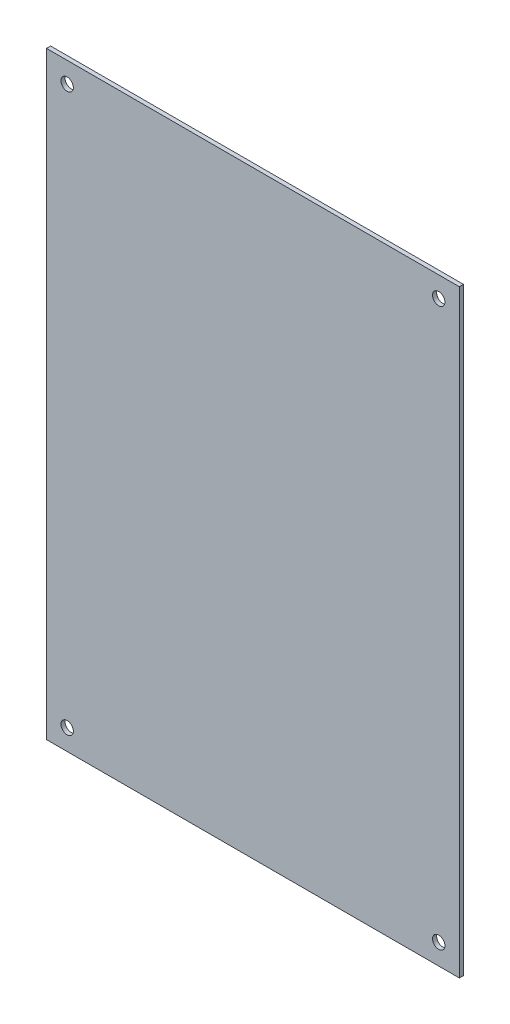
ISO-10303-21;
HEADER;
FILE_DESCRIPTION(('STEP AP214'),'2;1');
FILE_NAME('part.step','',(''),(''),'','','');
FILE_SCHEMA(('AUTOMOTIVE_DESIGN { 1 0 10303 214 1 1 1 1 }'));
ENDSEC;
DATA;
#1=APPLICATION_CONTEXT('core data for automotive mechanical design processes');
#2=APPLICATION_PROTOCOL_DEFINITION('international standard','automotive_design',2000,#1);
#3=PRODUCT_CONTEXT('',#1,'mechanical');
#4=PRODUCT('Part','Part','',(#3));
#5=PRODUCT_RELATED_PRODUCT_CATEGORY('part','',(#4));
#6=PRODUCT_DEFINITION_FORMATION('','',#4);
#7=PRODUCT_DEFINITION_CONTEXT('part definition',#1,'design');
#8=PRODUCT_DEFINITION('design','',#6,#7);
#9=PRODUCT_DEFINITION_SHAPE('','',#8);
#10=(LENGTH_UNIT() NAMED_UNIT(*) SI_UNIT(.MILLI.,.METRE.));
#11=(NAMED_UNIT(*) PLANE_ANGLE_UNIT() SI_UNIT($,.RADIAN.));
#12=(NAMED_UNIT(*) SI_UNIT($,.STERADIAN.) SOLID_ANGLE_UNIT());
#13=UNCERTAINTY_MEASURE_WITH_UNIT(LENGTH_MEASURE(1.E-05),#10,'distance_accuracy_value','');
#14=(GEOMETRIC_REPRESENTATION_CONTEXT(3) GLOBAL_UNCERTAINTY_ASSIGNED_CONTEXT((#13)) GLOBAL_UNIT_ASSIGNED_CONTEXT((#10,
#11,#12)) REPRESENTATION_CONTEXT('',''));
#15=CARTESIAN_POINT('',(0.,0.,0.));
#16=DIRECTION('',(0.,0.,1.));
#17=DIRECTION('',(1.,0.,0.));
#18=AXIS2_PLACEMENT_3D('',#15,#16,#17);
#19=CARTESIAN_POINT('',(-50.,0.,1.));
#20=DIRECTION('',(1.,0.,0.));
#21=DIRECTION('',(0.,1.,0.));
#22=AXIS2_PLACEMENT_3D('',#19,#20,#21);
#23=PLANE('',#22);
#24=DIRECTION('',(0.,-1.,0.));
#25=VECTOR('',#24,1.);
#26=CARTESIAN_POINT('',(-50.,0.,0.));
#27=LINE('',#26,#25);
#28=CARTESIAN_POINT('',(-50.,0.,0.));
#29=VERTEX_POINT('',#28);
#30=CARTESIAN_POINT('',(-50.0000000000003,-145.,0.));
#31=VERTEX_POINT('',#30);
#32=EDGE_CURVE('E83',#29,#31,#27,.T.);
#33=ORIENTED_EDGE('',*,*,#32,.T.);
#34=DIRECTION('',(0.,0.,-1.));
#35=VECTOR('',#34,1.);
#36=CARTESIAN_POINT('',(-50.0000000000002,-145.,1.));
#37=LINE('',#36,#35);
#38=CARTESIAN_POINT('',(-50.0000000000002,-145.,1.));
#39=VERTEX_POINT('',#38);
#40=EDGE_CURVE('E11',#39,#31,#37,.T.);
#41=ORIENTED_EDGE('',*,*,#40,.F.);
#42=DIRECTION('',(0.,-1.,0.));
#43=VECTOR('',#42,1.);
#44=CARTESIAN_POINT('',(-50.,0.,1.));
#45=LINE('',#44,#43);
#46=CARTESIAN_POINT('',(-50.,0.,1.));
#47=VERTEX_POINT('',#46);
#48=EDGE_CURVE('E112',#47,#39,#45,.T.);
#49=ORIENTED_EDGE('',*,*,#48,.F.);
#50=DIRECTION('',(0.,0.,-1.));
#51=VECTOR('',#50,1.);
#52=CARTESIAN_POINT('',(-50.,0.,1.));
#53=LINE('',#52,#51);
#54=EDGE_CURVE('E96',#47,#29,#53,.T.);
#55=ORIENTED_EDGE('',*,*,#54,.T.);
#56=EDGE_LOOP('',(#33,#41,#49,#55));
#57=FACE_BOUND('',#56,.T.);
#58=ADVANCED_FACE('F38',(#57),#23,.F.);
#59=CARTESIAN_POINT('',(-50.0000000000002,-145.,1.));
#60=DIRECTION('',(0.,1.,0.));
#61=DIRECTION('',(0.,0.,1.));
#62=AXIS2_PLACEMENT_3D('',#59,#60,#61);
#63=PLANE('',#62);
#64=DIRECTION('',(1.,0.,0.));
#65=VECTOR('',#64,1.);
#66=CARTESIAN_POINT('',(-50.0000000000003,-145.,0.));
#67=LINE('',#66,#65);
#68=CARTESIAN_POINT('',(49.9999999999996,-145.,-2.22044604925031E-13));
#69=VERTEX_POINT('',#68);
#70=EDGE_CURVE('E79',#31,#69,#67,.T.);
#71=ORIENTED_EDGE('',*,*,#70,.T.);
#72=DIRECTION('',(0.,0.,-1.));
#73=VECTOR('',#72,1.);
#74=CARTESIAN_POINT('',(49.9999999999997,-145.,0.999999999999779));
#75=LINE('',#74,#73);
#76=CARTESIAN_POINT('',(49.9999999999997,-145.,0.999999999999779));
#77=VERTEX_POINT('',#76);
#78=EDGE_CURVE('E46',#77,#69,#75,.T.);
#79=ORIENTED_EDGE('',*,*,#78,.F.);
#80=DIRECTION('',(1.,0.,0.));
#81=VECTOR('',#80,1.);
#82=CARTESIAN_POINT('',(-50.0000000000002,-145.,1.));
#83=LINE('',#82,#81);
#84=EDGE_CURVE('E92',#39,#77,#83,.T.);
#85=ORIENTED_EDGE('',*,*,#84,.F.);
#86=ORIENTED_EDGE('',*,*,#40,.T.);
#87=EDGE_LOOP('',(#71,#79,#85,#86));
#88=FACE_BOUND('',#87,.T.);
#89=ADVANCED_FACE('F91',(#88),#63,.F.);
#90=CARTESIAN_POINT('',(50.,0.,1.));
#91=DIRECTION('',(-1.,0.,0.));
#92=DIRECTION('',(0.,-1.,0.));
#93=AXIS2_PLACEMENT_3D('',#90,#91,#92);
#94=PLANE('',#93);
#95=DIRECTION('',(0.,1.,0.));
#96=VECTOR('',#95,1.);
#97=CARTESIAN_POINT('',(50.,0.,0.));
#98=LINE('',#97,#96);
#99=CARTESIAN_POINT('',(50.,0.,0.));
#100=VERTEX_POINT('',#99);
#101=EDGE_CURVE('E84',#69,#100,#98,.T.);
#102=ORIENTED_EDGE('',*,*,#101,.T.);
#103=DIRECTION('',(0.,0.,-1.));
#104=VECTOR('',#103,1.);
#105=CARTESIAN_POINT('',(50.,0.,1.));
#106=LINE('',#105,#104);
#107=CARTESIAN_POINT('',(50.,0.,1.));
#108=VERTEX_POINT('',#107);
#109=EDGE_CURVE('E123',#108,#100,#106,.T.);
#110=ORIENTED_EDGE('',*,*,#109,.F.);
#111=DIRECTION('',(0.,1.,0.));
#112=VECTOR('',#111,1.);
#113=CARTESIAN_POINT('',(50.,0.,1.));
#114=LINE('',#113,#112);
#115=EDGE_CURVE('E58',#77,#108,#114,.T.);
#116=ORIENTED_EDGE('',*,*,#115,.F.);
#117=ORIENTED_EDGE('',*,*,#78,.T.);
#118=EDGE_LOOP('',(#102,#110,#116,#117));
#119=FACE_BOUND('',#118,.T.);
#120=ADVANCED_FACE('F129',(#119),#94,.F.);
#121=CARTESIAN_POINT('',(-50.,0.,1.));
#122=DIRECTION('',(0.,-1.,0.));
#123=DIRECTION('',(0.,0.,-1.));
#124=AXIS2_PLACEMENT_3D('',#121,#122,#123);
#125=PLANE('',#124);
#126=DIRECTION('',(-1.,0.,0.));
#127=VECTOR('',#126,1.);
#128=CARTESIAN_POINT('',(-50.,0.,0.));
#129=LINE('',#128,#127);
#130=EDGE_CURVE('E109',#100,#29,#129,.T.);
#131=ORIENTED_EDGE('',*,*,#130,.T.);
#132=ORIENTED_EDGE('',*,*,#54,.F.);
#133=DIRECTION('',(-1.,0.,0.));
#134=VECTOR('',#133,1.);
#135=CARTESIAN_POINT('',(-50.,0.,1.));
#136=LINE('',#135,#134);
#137=EDGE_CURVE('E53',#108,#47,#136,.T.);
#138=ORIENTED_EDGE('',*,*,#137,.F.);
#139=ORIENTED_EDGE('',*,*,#109,.T.);
#140=EDGE_LOOP('',(#131,#132,#138,#139));
#141=FACE_BOUND('',#140,.T.);
#142=ADVANCED_FACE('F131',(#141),#125,.F.);
#143=CARTESIAN_POINT('',(-50.0000000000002,-145.,1.));
#144=DIRECTION('',(0.,0.,1.));
#145=DIRECTION('',(1.,0.,0.));
#146=AXIS2_PLACEMENT_3D('',#143,#144,#145);
#147=PLANE('',#146);
#148=CARTESIAN_POINT('',(-45.,-4.99999999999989,0.999999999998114));
#149=DIRECTION('',(0.,0.,1.));
#150=DIRECTION('',(1.,0.,0.));
#151=AXIS2_PLACEMENT_3D('',#148,#149,#150);
#152=CIRCLE('',#151,1.5);
#153=CARTESIAN_POINT('',(-43.5,-4.99999999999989,0.999999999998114));
#154=VERTEX_POINT('',#153);
#155=EDGE_CURVE('E238',#154,#154,#152,.T.);
#156=ORIENTED_EDGE('',*,*,#155,.F.);
#157=EDGE_LOOP('',(#156));
#158=FACE_BOUND('',#157,.T.);
#159=CARTESIAN_POINT('',(45.,-5.00000000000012,1.));
#160=DIRECTION('',(0.,0.,1.));
#161=DIRECTION('',(1.,0.,0.));
#162=AXIS2_PLACEMENT_3D('',#159,#160,#161);
#163=CIRCLE('',#162,1.5);
#164=CARTESIAN_POINT('',(46.5,-5.00000000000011,1.));
#165=VERTEX_POINT('',#164);
#166=EDGE_CURVE('E243',#165,#165,#163,.T.);
#167=ORIENTED_EDGE('',*,*,#166,.F.);
#168=EDGE_LOOP('',(#167));
#169=FACE_BOUND('',#168,.T.);
#170=CARTESIAN_POINT('',(-45.0000000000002,-140.,0.999999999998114));
#171=DIRECTION('',(0.,0.,1.));
#172=DIRECTION('',(1.,0.,0.));
#173=AXIS2_PLACEMENT_3D('',#170,#171,#172);
#174=CIRCLE('',#173,1.5);
#175=CARTESIAN_POINT('',(-43.5000000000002,-140.,0.999999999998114));
#176=VERTEX_POINT('',#175);
#177=EDGE_CURVE('E253',#176,#176,#174,.T.);
#178=ORIENTED_EDGE('',*,*,#177,.F.);
#179=EDGE_LOOP('',(#178));
#180=FACE_BOUND('',#179,.T.);
#181=CARTESIAN_POINT('',(44.9999999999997,-140.,0.999999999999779));
#182=DIRECTION('',(0.,0.,1.));
#183=DIRECTION('',(1.,0.,0.));
#184=AXIS2_PLACEMENT_3D('',#181,#182,#183);
#185=CIRCLE('',#184,1.5);
#186=CARTESIAN_POINT('',(46.4999999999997,-140.,0.999999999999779));
#187=VERTEX_POINT('',#186);
#188=EDGE_CURVE('E103',#187,#187,#185,.T.);
#189=ORIENTED_EDGE('',*,*,#188,.F.);
#190=EDGE_LOOP('',(#189));
#191=FACE_BOUND('',#190,.T.);
#192=ORIENTED_EDGE('',*,*,#48,.T.);
#193=ORIENTED_EDGE('',*,*,#84,.T.);
#194=ORIENTED_EDGE('',*,*,#115,.T.);
#195=ORIENTED_EDGE('',*,*,#137,.T.);
#196=EDGE_LOOP('',(#192,#193,#194,#195));
#197=FACE_BOUND('',#196,.T.);
#198=ADVANCED_FACE('F132',(#158,#169,#180,#191,#197),#147,.T.);
#199=CARTESIAN_POINT('',(-50.0000000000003,-145.,0.));
#200=DIRECTION('',(0.,0.,1.));
#201=DIRECTION('',(1.,0.,0.));
#202=AXIS2_PLACEMENT_3D('',#199,#200,#201);
#203=PLANE('',#202);
#204=CARTESIAN_POINT('',(-45.0000000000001,-4.99999999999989,-1.88737914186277E-12));
#205=DIRECTION('',(0.,0.,1.));
#206=DIRECTION('',(1.,0.,0.));
#207=AXIS2_PLACEMENT_3D('',#204,#205,#206);
#208=CIRCLE('',#207,1.5);
#209=CARTESIAN_POINT('',(-43.5000000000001,-4.99999999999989,-1.88737914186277E-12));
#210=VERTEX_POINT('',#209);
#211=EDGE_CURVE('E236',#210,#210,#208,.T.);
#212=ORIENTED_EDGE('',*,*,#211,.T.);
#213=EDGE_LOOP('',(#212));
#214=FACE_BOUND('',#213,.T.);
#215=CARTESIAN_POINT('',(44.9999999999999,-5.00000000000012,0.));
#216=DIRECTION('',(0.,0.,1.));
#217=DIRECTION('',(1.,0.,0.));
#218=AXIS2_PLACEMENT_3D('',#215,#216,#217);
#219=CIRCLE('',#218,1.5);
#220=CARTESIAN_POINT('',(46.4999999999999,-5.00000000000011,0.));
#221=VERTEX_POINT('',#220);
#222=EDGE_CURVE('E249',#221,#221,#219,.T.);
#223=ORIENTED_EDGE('',*,*,#222,.T.);
#224=EDGE_LOOP('',(#223));
#225=FACE_BOUND('',#224,.T.);
#226=CARTESIAN_POINT('',(-45.0000000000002,-140.,-1.88737914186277E-12));
#227=DIRECTION('',(0.,0.,1.));
#228=DIRECTION('',(1.,0.,0.));
#229=AXIS2_PLACEMENT_3D('',#226,#227,#228);
#230=CIRCLE('',#229,1.5);
#231=CARTESIAN_POINT('',(-43.5000000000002,-140.,-1.88737914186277E-12));
#232=VERTEX_POINT('',#231);
#233=EDGE_CURVE('E256',#232,#232,#230,.T.);
#234=ORIENTED_EDGE('',*,*,#233,.T.);
#235=EDGE_LOOP('',(#234));
#236=FACE_BOUND('',#235,.T.);
#237=CARTESIAN_POINT('',(44.9999999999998,-140.,-2.22044604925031E-13));
#238=DIRECTION('',(0.,0.,1.));
#239=DIRECTION('',(1.,0.,0.));
#240=AXIS2_PLACEMENT_3D('',#237,#238,#239);
#241=CIRCLE('',#240,1.5);
#242=CARTESIAN_POINT('',(46.4999999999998,-140.,-2.22044604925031E-13));
#243=VERTEX_POINT('',#242);
#244=EDGE_CURVE('E98',#243,#243,#241,.T.);
#245=ORIENTED_EDGE('',*,*,#244,.T.);
#246=EDGE_LOOP('',(#245));
#247=FACE_BOUND('',#246,.T.);
#248=ORIENTED_EDGE('',*,*,#32,.F.);
#249=ORIENTED_EDGE('',*,*,#130,.F.);
#250=ORIENTED_EDGE('',*,*,#101,.F.);
#251=ORIENTED_EDGE('',*,*,#70,.F.);
#252=EDGE_LOOP('',(#248,#249,#250,#251));
#253=FACE_BOUND('',#252,.T.);
#254=ADVANCED_FACE('F80',(#214,#225,#236,#247,#253),#203,.F.);
#255=CARTESIAN_POINT('',(44.9999999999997,-140.,0.999999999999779));
#256=DIRECTION('',(0.,0.,1.));
#257=DIRECTION('',(1.,0.,0.));
#258=AXIS2_PLACEMENT_3D('',#255,#256,#257);
#259=CYLINDRICAL_SURFACE('',#258,1.5);
#260=ORIENTED_EDGE('',*,*,#244,.F.);
#261=EDGE_LOOP('',(#260));
#262=FACE_BOUND('',#261,.T.);
#263=ORIENTED_EDGE('',*,*,#188,.T.);
#264=EDGE_LOOP('',(#263));
#265=FACE_BOUND('',#264,.T.);
#266=ADVANCED_FACE('F140',(#262,#265),#259,.F.);
#267=CARTESIAN_POINT('',(-45.0000000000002,-140.,0.999999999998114));
#268=DIRECTION('',(0.,0.,1.));
#269=DIRECTION('',(1.,0.,0.));
#270=AXIS2_PLACEMENT_3D('',#267,#268,#269);
#271=CYLINDRICAL_SURFACE('',#270,1.5);
#272=ORIENTED_EDGE('',*,*,#233,.F.);
#273=EDGE_LOOP('',(#272));
#274=FACE_BOUND('',#273,.T.);
#275=ORIENTED_EDGE('',*,*,#177,.T.);
#276=EDGE_LOOP('',(#275));
#277=FACE_BOUND('',#276,.T.);
#278=ADVANCED_FACE('F176',(#274,#277),#271,.F.);
#279=CARTESIAN_POINT('',(45.,-5.00000000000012,1.));
#280=DIRECTION('',(0.,0.,1.));
#281=DIRECTION('',(1.,0.,0.));
#282=AXIS2_PLACEMENT_3D('',#279,#280,#281);
#283=CYLINDRICAL_SURFACE('',#282,1.5);
#284=ORIENTED_EDGE('',*,*,#222,.F.);
#285=EDGE_LOOP('',(#284));
#286=FACE_BOUND('',#285,.T.);
#287=ORIENTED_EDGE('',*,*,#166,.T.);
#288=EDGE_LOOP('',(#287));
#289=FACE_BOUND('',#288,.T.);
#290=ADVANCED_FACE('F185',(#286,#289),#283,.F.);
#291=CARTESIAN_POINT('',(-45.,-4.99999999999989,0.999999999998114));
#292=DIRECTION('',(0.,0.,1.));
#293=DIRECTION('',(1.,0.,0.));
#294=AXIS2_PLACEMENT_3D('',#291,#292,#293);
#295=CYLINDRICAL_SURFACE('',#294,1.5);
#296=ORIENTED_EDGE('',*,*,#211,.F.);
#297=EDGE_LOOP('',(#296));
#298=FACE_BOUND('',#297,.T.);
#299=ORIENTED_EDGE('',*,*,#155,.T.);
#300=EDGE_LOOP('',(#299));
#301=FACE_BOUND('',#300,.T.);
#302=ADVANCED_FACE('F194',(#298,#301),#295,.F.);
#303=CLOSED_SHELL('',(#58,#89,#120,#142,#198,#254,#266,#278,#290,#302));
#304=MANIFOLD_SOLID_BREP('B2',#303);
#305=ADVANCED_BREP_SHAPE_REPRESENTATION('',(#18,#304),#14);
#306=SHAPE_DEFINITION_REPRESENTATION(#9,#305);
ENDSEC;
END-ISO-10303-21;
